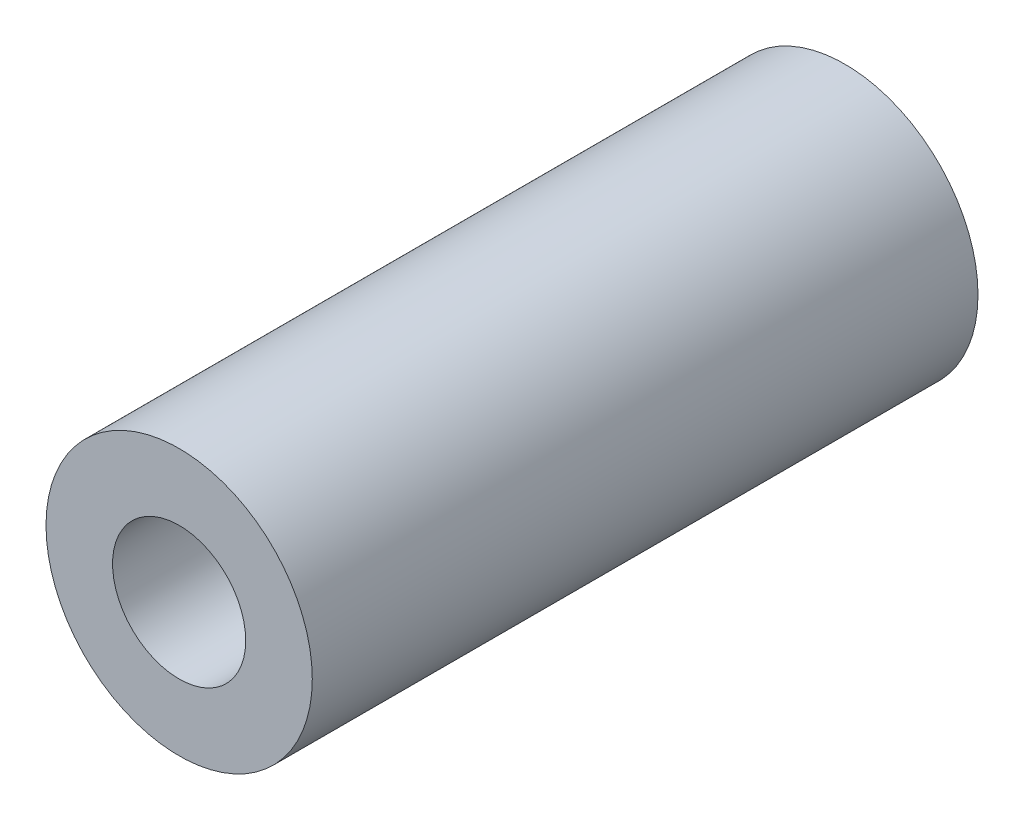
from build123d import *

# Parameters (mm, degrees)
ESQUISSE1_R             = 3
BOSS_EXTRU_1_DEPTH      = 15
ENL_V_MAT_EXTRU_1_REACH = 17.588
ESQUISSE2_R             = 1.5


with BuildPart() as part:
    # Esquisse1 → Boss.-Extru.1 (new body)
    with BuildSketch(Plane.XY):
        Circle(ESQUISSE1_R)
    extrude(amount=BOSS_EXTRU_1_DEPTH)

    # Esquisse2 → Enl_v. mat.-Extru.1 (cut, up to next)
    with BuildSketch(Plane.XY.offset(15), mode=Mode.PRIVATE) as enl_v_mat_extru_1_sk1:
        Circle(ESQUISSE2_R)
    enl_v_mat_extru_1_tool1 = extrude(enl_v_mat_extru_1_sk1.sketch, amount=-ENL_V_MAT_EXTRU_1_REACH, mode=Mode.PRIVATE) & part.part
    add(enl_v_mat_extru_1_tool1.solids().sort_by_distance((0, 0, 15))[0], mode=Mode.SUBTRACT)


solid = part.part
